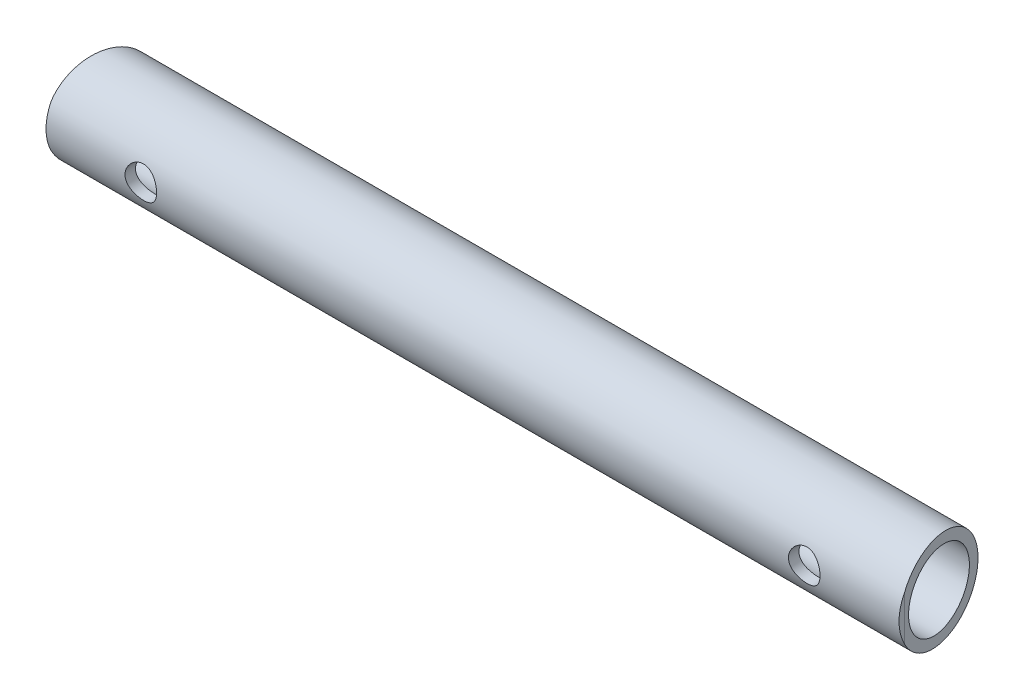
ISO-10303-21;
HEADER;
FILE_DESCRIPTION(('STEP AP214'),'2;1');
FILE_NAME('part.step','',(''),(''),'','','');
FILE_SCHEMA(('AUTOMOTIVE_DESIGN { 1 0 10303 214 1 1 1 1 }'));
ENDSEC;
DATA;
#1=APPLICATION_CONTEXT('core data for automotive mechanical design processes');
#2=APPLICATION_PROTOCOL_DEFINITION('international standard','automotive_design',2000,#1);
#3=PRODUCT_CONTEXT('',#1,'mechanical');
#4=PRODUCT('Part','Part','',(#3));
#5=PRODUCT_RELATED_PRODUCT_CATEGORY('part','',(#4));
#6=PRODUCT_DEFINITION_FORMATION('','',#4);
#7=PRODUCT_DEFINITION_CONTEXT('part definition',#1,'design');
#8=PRODUCT_DEFINITION('design','',#6,#7);
#9=PRODUCT_DEFINITION_SHAPE('','',#8);
#10=(LENGTH_UNIT() NAMED_UNIT(*) SI_UNIT(.MILLI.,.METRE.));
#11=(NAMED_UNIT(*) PLANE_ANGLE_UNIT() SI_UNIT($,.RADIAN.));
#12=(NAMED_UNIT(*) SI_UNIT($,.STERADIAN.) SOLID_ANGLE_UNIT());
#13=UNCERTAINTY_MEASURE_WITH_UNIT(LENGTH_MEASURE(1.E-05),#10,'distance_accuracy_value','');
#14=(GEOMETRIC_REPRESENTATION_CONTEXT(3) GLOBAL_UNCERTAINTY_ASSIGNED_CONTEXT((#13)) GLOBAL_UNIT_ASSIGNED_CONTEXT((#10,
#11,#12)) REPRESENTATION_CONTEXT('',''));
#15=CARTESIAN_POINT('',(0.,0.,0.));
#16=DIRECTION('',(0.,0.,1.));
#17=DIRECTION('',(1.,0.,0.));
#18=AXIS2_PLACEMENT_3D('',#15,#16,#17);
#19=CARTESIAN_POINT('',(-85.725,9.52499999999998,0.));
#20=DIRECTION('',(1.,0.,0.));
#21=DIRECTION('',(0.,0.,-1.));
#22=AXIS2_PLACEMENT_3D('',#19,#20,#21);
#23=PLANE('',#22);
#24=CARTESIAN_POINT('',(-85.725,0.,0.));
#25=DIRECTION('',(-1.,0.,0.));
#26=DIRECTION('',(0.,0.,1.));
#27=AXIS2_PLACEMENT_3D('',#24,#25,#26);
#28=CIRCLE('',#27,9.52499999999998);
#29=CARTESIAN_POINT('',(-85.725,-4.38629045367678,8.45494417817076));
#30=VERTEX_POINT('',#29);
#31=CARTESIAN_POINT('',(-85.725,4.38629045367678,8.45494417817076));
#32=VERTEX_POINT('',#31);
#33=EDGE_CURVE('E75',#30,#32,#28,.T.);
#34=ORIENTED_EDGE('',*,*,#33,.T.);
#35=DIRECTION('',(0.,-1.,0.));
#36=VECTOR('',#35,1.);
#37=CARTESIAN_POINT('',(-85.725,9.52499999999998,8.45494417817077));
#38=LINE('',#37,#36);
#39=EDGE_CURVE('E58',#32,#30,#38,.T.);
#40=ORIENTED_EDGE('',*,*,#39,.T.);
#41=EDGE_LOOP('',(#34,#40));
#42=FACE_BOUND('',#41,.T.);
#43=ADVANCED_FACE('F33',(#42),#23,.F.);
#44=CARTESIAN_POINT('',(0.,0.,0.));
#45=DIRECTION('',(-1.,0.,0.));
#46=DIRECTION('',(0.,0.,1.));
#47=AXIS2_PLACEMENT_3D('',#44,#45,#46);
#48=CYLINDRICAL_SURFACE('',#47,7.41679999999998);
#49=CARTESIAN_POINT('',(69.85,0.,7.41679999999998));
#50=CARTESIAN_POINT('',(69.8499989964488,0.0848685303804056,7.4167992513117));
#51=CARTESIAN_POINT('',(69.8465902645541,0.16976685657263,7.41533786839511));
#52=CARTESIAN_POINT('',(69.8330007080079,0.338935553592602,7.40953686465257));
#53=CARTESIAN_POINT('',(69.8228157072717,0.423205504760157,7.40519546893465));
#54=CARTESIAN_POINT('',(69.7821671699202,0.674445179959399,7.38797152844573));
#55=CARTESIAN_POINT('',(69.7416103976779,0.839625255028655,7.3708896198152));
#56=CARTESIAN_POINT('',(69.6354582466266,1.15961045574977,7.32736691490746));
#57=CARTESIAN_POINT('',(69.5699495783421,1.3144493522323,7.30095855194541));
#58=CARTESIAN_POINT('',(69.4161221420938,1.61081910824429,7.24134158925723));
#59=CARTESIAN_POINT('',(69.3278095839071,1.75235357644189,7.20813484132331));
#60=CARTESIAN_POINT('',(69.1260017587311,2.02569802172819,7.13627384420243));
#61=CARTESIAN_POINT('',(69.0115029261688,2.15671754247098,7.09743485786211));
#62=CARTESIAN_POINT('',(68.7626979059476,2.39838366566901,7.01946076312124));
#63=CARTESIAN_POINT('',(68.6283808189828,2.50901898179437,6.98032550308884));
#64=CARTESIAN_POINT('',(68.335198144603,2.71253529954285,6.90387749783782));
#65=CARTESIAN_POINT('',(68.1754129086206,2.80417626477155,6.86676890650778));
#66=CARTESIAN_POINT('',(67.8408822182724,2.95892796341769,6.80152720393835));
#67=CARTESIAN_POINT('',(67.6661449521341,3.02205419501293,6.77338921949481));
#68=CARTESIAN_POINT('',(67.3157640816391,3.11467625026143,6.73128523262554));
#69=CARTESIAN_POINT('',(67.1406033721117,3.14569687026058,6.71668052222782));
#70=CARTESIAN_POINT('',(66.7870012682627,3.17797871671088,6.70147195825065));
#71=CARTESIAN_POINT('',(66.6085618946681,3.17925769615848,6.70085975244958));
#72=CARTESIAN_POINT('',(66.2690579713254,3.153163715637,6.7131679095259));
#73=CARTESIAN_POINT('',(66.1077658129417,3.12812513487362,6.72498577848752));
#74=CARTESIAN_POINT('',(65.7919416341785,3.05403884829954,6.75895049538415));
#75=CARTESIAN_POINT('',(65.6374110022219,3.00498623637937,6.78109945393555));
#76=CARTESIAN_POINT('',(65.3354856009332,2.88329810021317,6.83373794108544));
#77=CARTESIAN_POINT('',(65.1883199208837,2.81017164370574,6.86439881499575));
#78=CARTESIAN_POINT('',(64.9077552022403,2.64276086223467,6.93057186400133));
#79=CARTESIAN_POINT('',(64.7743617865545,2.54846794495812,6.96608600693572));
#80=CARTESIAN_POINT('',(64.5125366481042,2.33148257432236,7.04183549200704));
#81=CARTESIAN_POINT('',(64.3856226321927,2.20700163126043,7.08220861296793));
#82=CARTESIAN_POINT('',(64.1539460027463,1.93814614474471,7.16045401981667));
#83=CARTESIAN_POINT('',(64.0491891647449,1.79376643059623,7.19832565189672));
#84=CARTESIAN_POINT('',(63.8624039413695,1.48438092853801,7.26851411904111));
#85=CARTESIAN_POINT('',(63.7810258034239,1.31894185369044,7.30066399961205));
#86=CARTESIAN_POINT('',(63.6477949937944,0.974992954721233,7.35449045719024));
#87=CARTESIAN_POINT('',(63.5959250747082,0.796490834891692,7.37617315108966));
#88=CARTESIAN_POINT('',(63.5264357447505,0.444137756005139,7.40545981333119));
#89=CARTESIAN_POINT('',(63.5067815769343,0.270757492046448,7.41389859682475));
#90=CARTESIAN_POINT('',(63.4961746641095,-0.077016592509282,7.41843612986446));
#91=CARTESIAN_POINT('',(63.5052130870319,-0.251410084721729,7.41453867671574));
#92=CARTESIAN_POINT('',(63.5503078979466,-0.586513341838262,7.39537865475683));
#93=CARTESIAN_POINT('',(63.5849066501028,-0.7474584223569,7.38072950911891));
#94=CARTESIAN_POINT('',(63.6780791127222,-1.06106519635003,7.34220943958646));
#95=CARTESIAN_POINT('',(63.736655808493,-1.21372585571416,7.31833736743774));
#96=CARTESIAN_POINT('',(63.8780231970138,-1.51182352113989,7.26271514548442));
#97=CARTESIAN_POINT('',(63.9615128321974,-1.65688614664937,7.23074228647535));
#98=CARTESIAN_POINT('',(64.1495717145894,-1.93146513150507,7.16229158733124));
#99=CARTESIAN_POINT('',(64.2541499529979,-2.06097482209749,7.12581182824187));
#100=CARTESIAN_POINT('',(64.4906048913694,-2.31102378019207,7.0488630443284));
#101=CARTESIAN_POINT('',(64.6239432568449,-2.43015555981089,7.00830034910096));
#102=CARTESIAN_POINT('',(64.9093105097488,-2.64477775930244,6.93016229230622));
#103=CARTESIAN_POINT('',(65.0613445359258,-2.74026165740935,6.89258775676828));
#104=CARTESIAN_POINT('',(65.3835759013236,-2.90624364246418,6.82428763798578));
#105=CARTESIAN_POINT('',(65.5540482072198,-2.97626710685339,6.79369576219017));
#106=CARTESIAN_POINT('',(65.9060935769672,-3.08598792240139,6.74457417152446));
#107=CARTESIAN_POINT('',(66.0876566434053,-3.12571216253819,6.7260337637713));
#108=CARTESIAN_POINT('',(66.4410262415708,-3.17096614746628,6.70480897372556));
#109=CARTESIAN_POINT('',(66.6124458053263,-3.17898510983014,6.70097111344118));
#110=CARTESIAN_POINT('',(66.9541048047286,-3.16732136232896,6.70649259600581));
#111=CARTESIAN_POINT('',(67.1243444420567,-3.14764351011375,6.71584962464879));
#112=CARTESIAN_POINT('',(67.4496852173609,-3.0832734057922,6.74562770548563));
#113=CARTESIAN_POINT('',(67.6051136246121,-3.03993090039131,6.76545000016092));
#114=CARTESIAN_POINT('',(67.9065072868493,-2.93082240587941,6.81342307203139));
#115=CARTESIAN_POINT('',(68.0524698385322,-2.8650500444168,6.84157621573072));
#116=CARTESIAN_POINT('',(68.3406620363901,-2.70827448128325,6.90519670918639));
#117=CARTESIAN_POINT('',(68.4821014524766,-2.61596158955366,6.94100891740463));
#118=CARTESIAN_POINT('',(68.7482613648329,-2.41049684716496,7.01500786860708));
#119=CARTESIAN_POINT('',(68.8729755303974,-2.29733714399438,7.05319550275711));
#120=CARTESIAN_POINT('',(69.1122423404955,-2.04287378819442,7.13124521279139));
#121=CARTESIAN_POINT('',(69.2252242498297,-1.90005657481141,7.17100275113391));
#122=CARTESIAN_POINT('',(69.4257655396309,-1.59594216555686,7.24474147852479));
#123=CARTESIAN_POINT('',(69.5133133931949,-1.43463663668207,7.27872004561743));
#124=CARTESIAN_POINT('',(69.6225808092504,-1.18347380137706,7.32225776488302));
#125=CARTESIAN_POINT('',(69.6551778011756,-1.09882926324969,7.33546627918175));
#126=CARTESIAN_POINT('',(69.7130942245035,-0.926732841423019,7.35918537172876));
#127=CARTESIAN_POINT('',(69.7384171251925,-0.839282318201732,7.36969723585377));
#128=CARTESIAN_POINT('',(69.781450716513,-0.662460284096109,7.38768932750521));
#129=CARTESIAN_POINT('',(69.7991799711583,-0.573094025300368,7.39517694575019));
#130=CARTESIAN_POINT('',(69.8268981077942,-0.393003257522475,7.40692915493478));
#131=CARTESIAN_POINT('',(69.8368925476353,-0.302279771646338,7.41119606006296));
#132=CARTESIAN_POINT('',(69.8453072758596,-0.176125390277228,7.41479215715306));
#133=CARTESIAN_POINT('',(69.8470664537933,-0.140929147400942,7.41554459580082));
#134=CARTESIAN_POINT('',(69.849413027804,-0.0704903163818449,7.41654867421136));
#135=CARTESIAN_POINT('',(69.8500004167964,-0.0352477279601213,7.41680031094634));
#136=CARTESIAN_POINT('',(69.85,0.,7.41679999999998));
#137=B_SPLINE_CURVE_WITH_KNOTS('',3,(#49,#50,#51,#52,#53,#54,#55,#56,#57,#58,#59,#60,#61,#62,
#63,#64,#65,#66,#67,#68,#69,#70,#71,#72,#73,#74,#75,#76,#77,#78,#79,#80,#81,#82,#83,#84,#85,#86,
#87,#88,#89,#90,#91,#92,#93,#94,#95,#96,#97,#98,#99,#100,#101,#102,#103,#104,#105,#106,#107,
#108,#109,#110,#111,#112,#113,#114,#115,#116,#117,#118,#119,#120,#121,#122,#123,#124,#125,#126,
#127,#128,#129,#130,#131,#132,#133,#134,#135,#136),.UNSPECIFIED.,.T.,.F.,(4,2,2,2,2,2,2,2,2,2,2,
2,2,2,2,2,2,2,2,2,2,2,2,2,2,2,2,2,2,2,2,2,2,2,2,2,2,2,2,2,2,2,2,4),(0.,0.254567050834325,
0.509291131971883,1.01938893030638,1.52773002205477,2.0359328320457,2.56847670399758,
3.10131455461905,3.66218072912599,4.22274169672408,4.7552522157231,5.2874448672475,
5.77611896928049,6.26489294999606,6.7643253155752,7.2639607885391,7.80840227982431,
8.35298551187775,8.91150514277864,9.46969798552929,9.99104666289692,10.512234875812,
11.0057946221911,11.4994158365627,12.0084497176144,12.5177010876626,13.0652576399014,
13.6129650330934,14.1704143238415,14.7273683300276,15.2396080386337,15.7517579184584,
16.2373557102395,16.7230915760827,17.2388920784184,17.7548872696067,18.3114667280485,
18.8682980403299,19.1429755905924,19.4175219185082,19.6913931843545,19.9650674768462,
20.0707940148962,20.1765211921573),.UNSPECIFIED.);
#138=CARTESIAN_POINT('',(69.85,0.,7.41679999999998));
#139=VERTEX_POINT('',#138);
#140=EDGE_CURVE('E90',#139,#139,#137,.T.);
#141=ORIENTED_EDGE('',*,*,#140,.T.);
#142=EDGE_LOOP('',(#141));
#143=FACE_BOUND('',#142,.T.);
#144=CARTESIAN_POINT('',(69.85,0.,-7.41679999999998));
#145=CARTESIAN_POINT('',(69.8499989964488,-0.0848685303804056,-7.4167992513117));
#146=CARTESIAN_POINT('',(69.8465902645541,-0.16976685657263,-7.41533786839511));
#147=CARTESIAN_POINT('',(69.8330007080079,-0.338935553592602,-7.40953686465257));
#148=CARTESIAN_POINT('',(69.8228157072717,-0.423205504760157,-7.40519546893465));
#149=CARTESIAN_POINT('',(69.7821671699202,-0.674445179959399,-7.38797152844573));
#150=CARTESIAN_POINT('',(69.7416103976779,-0.839625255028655,-7.3708896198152));
#151=CARTESIAN_POINT('',(69.6354582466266,-1.15961045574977,-7.32736691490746));
#152=CARTESIAN_POINT('',(69.5699495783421,-1.3144493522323,-7.30095855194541));
#153=CARTESIAN_POINT('',(69.4161221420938,-1.61081910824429,-7.24134158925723));
#154=CARTESIAN_POINT('',(69.3278095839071,-1.75235357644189,-7.20813484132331));
#155=CARTESIAN_POINT('',(69.1260017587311,-2.02569802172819,-7.13627384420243));
#156=CARTESIAN_POINT('',(69.0115029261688,-2.15671754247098,-7.09743485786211));
#157=CARTESIAN_POINT('',(68.7626979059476,-2.39838366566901,-7.01946076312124));
#158=CARTESIAN_POINT('',(68.6283808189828,-2.50901898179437,-6.98032550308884));
#159=CARTESIAN_POINT('',(68.335198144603,-2.71253529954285,-6.90387749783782));
#160=CARTESIAN_POINT('',(68.1754129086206,-2.80417626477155,-6.86676890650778));
#161=CARTESIAN_POINT('',(67.8408822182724,-2.95892796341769,-6.80152720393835));
#162=CARTESIAN_POINT('',(67.6661449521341,-3.02205419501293,-6.77338921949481));
#163=CARTESIAN_POINT('',(67.3157640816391,-3.11467625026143,-6.73128523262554));
#164=CARTESIAN_POINT('',(67.1406033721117,-3.14569687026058,-6.71668052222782));
#165=CARTESIAN_POINT('',(66.7870012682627,-3.17797871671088,-6.70147195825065));
#166=CARTESIAN_POINT('',(66.6085618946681,-3.17925769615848,-6.70085975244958));
#167=CARTESIAN_POINT('',(66.2690579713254,-3.153163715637,-6.7131679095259));
#168=CARTESIAN_POINT('',(66.1077658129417,-3.12812513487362,-6.72498577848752));
#169=CARTESIAN_POINT('',(65.7919416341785,-3.05403884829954,-6.75895049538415));
#170=CARTESIAN_POINT('',(65.6374110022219,-3.00498623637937,-6.78109945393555));
#171=CARTESIAN_POINT('',(65.3354856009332,-2.88329810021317,-6.83373794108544));
#172=CARTESIAN_POINT('',(65.1883199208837,-2.81017164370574,-6.86439881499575));
#173=CARTESIAN_POINT('',(64.9077552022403,-2.64276086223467,-6.93057186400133));
#174=CARTESIAN_POINT('',(64.7743617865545,-2.54846794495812,-6.96608600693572));
#175=CARTESIAN_POINT('',(64.5125366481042,-2.33148257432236,-7.04183549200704));
#176=CARTESIAN_POINT('',(64.3856226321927,-2.20700163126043,-7.08220861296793));
#177=CARTESIAN_POINT('',(64.1539460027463,-1.93814614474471,-7.16045401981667));
#178=CARTESIAN_POINT('',(64.0491891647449,-1.79376643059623,-7.19832565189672));
#179=CARTESIAN_POINT('',(63.8624039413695,-1.48438092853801,-7.26851411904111));
#180=CARTESIAN_POINT('',(63.7810258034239,-1.31894185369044,-7.30066399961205));
#181=CARTESIAN_POINT('',(63.6477949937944,-0.974992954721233,-7.35449045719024));
#182=CARTESIAN_POINT('',(63.5959250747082,-0.796490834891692,-7.37617315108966));
#183=CARTESIAN_POINT('',(63.5264357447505,-0.444137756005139,-7.40545981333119));
#184=CARTESIAN_POINT('',(63.5067815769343,-0.270757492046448,-7.41389859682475));
#185=CARTESIAN_POINT('',(63.4961746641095,0.077016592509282,-7.41843612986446));
#186=CARTESIAN_POINT('',(63.5052130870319,0.251410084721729,-7.41453867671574));
#187=CARTESIAN_POINT('',(63.5503078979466,0.586513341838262,-7.39537865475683));
#188=CARTESIAN_POINT('',(63.5849066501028,0.7474584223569,-7.38072950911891));
#189=CARTESIAN_POINT('',(63.6780791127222,1.06106519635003,-7.34220943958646));
#190=CARTESIAN_POINT('',(63.736655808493,1.21372585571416,-7.31833736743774));
#191=CARTESIAN_POINT('',(63.8780231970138,1.51182352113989,-7.26271514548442));
#192=CARTESIAN_POINT('',(63.9615128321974,1.65688614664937,-7.23074228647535));
#193=CARTESIAN_POINT('',(64.1495717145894,1.93146513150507,-7.16229158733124));
#194=CARTESIAN_POINT('',(64.2541499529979,2.06097482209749,-7.12581182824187));
#195=CARTESIAN_POINT('',(64.4906048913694,2.31102378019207,-7.0488630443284));
#196=CARTESIAN_POINT('',(64.6239432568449,2.43015555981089,-7.00830034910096));
#197=CARTESIAN_POINT('',(64.9093105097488,2.64477775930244,-6.93016229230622));
#198=CARTESIAN_POINT('',(65.0613445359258,2.74026165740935,-6.89258775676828));
#199=CARTESIAN_POINT('',(65.3835759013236,2.90624364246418,-6.82428763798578));
#200=CARTESIAN_POINT('',(65.5540482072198,2.97626710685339,-6.79369576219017));
#201=CARTESIAN_POINT('',(65.9060935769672,3.08598792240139,-6.74457417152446));
#202=CARTESIAN_POINT('',(66.0876566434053,3.12571216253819,-6.7260337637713));
#203=CARTESIAN_POINT('',(66.4410262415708,3.17096614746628,-6.70480897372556));
#204=CARTESIAN_POINT('',(66.6124458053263,3.17898510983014,-6.70097111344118));
#205=CARTESIAN_POINT('',(66.9541048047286,3.16732136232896,-6.70649259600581));
#206=CARTESIAN_POINT('',(67.1243444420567,3.14764351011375,-6.71584962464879));
#207=CARTESIAN_POINT('',(67.4496852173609,3.0832734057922,-6.74562770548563));
#208=CARTESIAN_POINT('',(67.6051136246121,3.03993090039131,-6.76545000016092));
#209=CARTESIAN_POINT('',(67.9065072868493,2.93082240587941,-6.81342307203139));
#210=CARTESIAN_POINT('',(68.0524698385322,2.8650500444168,-6.84157621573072));
#211=CARTESIAN_POINT('',(68.3406620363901,2.70827448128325,-6.90519670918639));
#212=CARTESIAN_POINT('',(68.4821014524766,2.61596158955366,-6.94100891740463));
#213=CARTESIAN_POINT('',(68.7482613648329,2.41049684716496,-7.01500786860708));
#214=CARTESIAN_POINT('',(68.8729755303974,2.29733714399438,-7.05319550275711));
#215=CARTESIAN_POINT('',(69.1122423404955,2.04287378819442,-7.13124521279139));
#216=CARTESIAN_POINT('',(69.2252242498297,1.90005657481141,-7.17100275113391));
#217=CARTESIAN_POINT('',(69.4257655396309,1.59594216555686,-7.24474147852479));
#218=CARTESIAN_POINT('',(69.5133133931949,1.43463663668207,-7.27872004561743));
#219=CARTESIAN_POINT('',(69.6225808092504,1.18347380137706,-7.32225776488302));
#220=CARTESIAN_POINT('',(69.6551778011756,1.09882926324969,-7.33546627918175));
#221=CARTESIAN_POINT('',(69.7130942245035,0.926732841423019,-7.35918537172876));
#222=CARTESIAN_POINT('',(69.7384171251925,0.839282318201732,-7.36969723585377));
#223=CARTESIAN_POINT('',(69.781450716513,0.662460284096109,-7.38768932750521));
#224=CARTESIAN_POINT('',(69.7991799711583,0.573094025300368,-7.39517694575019));
#225=CARTESIAN_POINT('',(69.8268981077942,0.393003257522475,-7.40692915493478));
#226=CARTESIAN_POINT('',(69.8368925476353,0.302279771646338,-7.41119606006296));
#227=CARTESIAN_POINT('',(69.8453072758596,0.176125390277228,-7.41479215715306));
#228=CARTESIAN_POINT('',(69.8470664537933,0.140929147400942,-7.41554459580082));
#229=CARTESIAN_POINT('',(69.849413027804,0.0704903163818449,-7.41654867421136));
#230=CARTESIAN_POINT('',(69.8500004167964,0.0352477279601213,-7.41680031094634));
#231=CARTESIAN_POINT('',(69.85,0.,-7.41679999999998));
#232=B_SPLINE_CURVE_WITH_KNOTS('',3,(#144,#145,#146,#147,#148,#149,#150,#151,#152,#153,#154,
#155,#156,#157,#158,#159,#160,#161,#162,#163,#164,#165,#166,#167,#168,#169,#170,#171,#172,#173,
#174,#175,#176,#177,#178,#179,#180,#181,#182,#183,#184,#185,#186,#187,#188,#189,#190,#191,#192,
#193,#194,#195,#196,#197,#198,#199,#200,#201,#202,#203,#204,#205,#206,#207,#208,#209,#210,#211,
#212,#213,#214,#215,#216,#217,#218,#219,#220,#221,#222,#223,#224,#225,#226,#227,#228,#229,#230,
#231),.UNSPECIFIED.,.T.,.F.,(4,2,2,2,2,2,2,2,2,2,2,2,2,2,2,2,2,2,2,2,2,2,2,2,2,2,2,2,2,2,2,2,2,
2,2,2,2,2,2,2,2,2,2,4),(0.,0.254567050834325,0.509291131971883,1.01938893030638,
1.52773002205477,2.0359328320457,2.56847670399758,3.10131455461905,3.66218072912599,
4.22274169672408,4.7552522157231,5.2874448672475,5.77611896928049,6.26489294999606,
6.7643253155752,7.2639607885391,7.80840227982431,8.35298551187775,8.91150514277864,
9.46969798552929,9.99104666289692,10.512234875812,11.0057946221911,11.4994158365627,
12.0084497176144,12.5177010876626,13.0652576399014,13.6129650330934,14.1704143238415,
14.7273683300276,15.2396080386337,15.7517579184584,16.2373557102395,16.7230915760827,
17.2388920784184,17.7548872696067,18.3114667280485,18.8682980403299,19.1429755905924,
19.4175219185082,19.6913931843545,19.9650674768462,20.0707940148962,20.1765211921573),.UNSPECIFIED.);
#233=CARTESIAN_POINT('',(69.85,0.,-7.41679999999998));
#234=VERTEX_POINT('',#233);
#235=EDGE_CURVE('E127',#234,#234,#232,.T.);
#236=ORIENTED_EDGE('',*,*,#235,.T.);
#237=EDGE_LOOP('',(#236));
#238=FACE_BOUND('',#237,.T.);
#239=CARTESIAN_POINT('',(-63.5,0.,7.41679999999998));
#240=CARTESIAN_POINT('',(-63.5000010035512,0.0848685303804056,7.4167992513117));
#241=CARTESIAN_POINT('',(-63.5034097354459,0.16976685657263,7.41533786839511));
#242=CARTESIAN_POINT('',(-63.5169992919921,0.338935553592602,7.40953686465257));
#243=CARTESIAN_POINT('',(-63.5271842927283,0.423205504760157,7.40519546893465));
#244=CARTESIAN_POINT('',(-63.5678328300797,0.674445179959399,7.38797152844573));
#245=CARTESIAN_POINT('',(-63.608389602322,0.839625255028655,7.3708896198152));
#246=CARTESIAN_POINT('',(-63.7145417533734,1.15961045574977,7.32736691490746));
#247=CARTESIAN_POINT('',(-63.7800504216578,1.3144493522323,7.30095855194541));
#248=CARTESIAN_POINT('',(-63.9338778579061,1.61081910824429,7.24134158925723));
#249=CARTESIAN_POINT('',(-64.0221904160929,1.75235357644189,7.20813484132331));
#250=CARTESIAN_POINT('',(-64.2239982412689,2.02569802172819,7.13627384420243));
#251=CARTESIAN_POINT('',(-64.3384970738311,2.15671754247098,7.09743485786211));
#252=CARTESIAN_POINT('',(-64.5873020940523,2.39838366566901,7.01946076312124));
#253=CARTESIAN_POINT('',(-64.7216191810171,2.50901898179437,6.98032550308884));
#254=CARTESIAN_POINT('',(-65.014801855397,2.71253529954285,6.90387749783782));
#255=CARTESIAN_POINT('',(-65.1745870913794,2.80417626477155,6.86676890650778));
#256=CARTESIAN_POINT('',(-65.5091177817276,2.95892796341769,6.80152720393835));
#257=CARTESIAN_POINT('',(-65.6838550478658,3.02205419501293,6.77338921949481));
#258=CARTESIAN_POINT('',(-66.0342359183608,3.11467625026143,6.73128523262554));
#259=CARTESIAN_POINT('',(-66.2093966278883,3.14569687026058,6.71668052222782));
#260=CARTESIAN_POINT('',(-66.5629987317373,3.17797871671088,6.70147195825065));
#261=CARTESIAN_POINT('',(-66.7414381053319,3.17925769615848,6.70085975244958));
#262=CARTESIAN_POINT('',(-67.0809420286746,3.153163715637,6.7131679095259));
#263=CARTESIAN_POINT('',(-67.2422341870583,3.12812513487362,6.72498577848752));
#264=CARTESIAN_POINT('',(-67.5580583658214,3.05403884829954,6.75895049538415));
#265=CARTESIAN_POINT('',(-67.712588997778,3.00498623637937,6.78109945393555));
#266=CARTESIAN_POINT('',(-68.0145143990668,2.88329810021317,6.83373794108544));
#267=CARTESIAN_POINT('',(-68.1616800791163,2.81017164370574,6.86439881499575));
#268=CARTESIAN_POINT('',(-68.4422447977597,2.64276086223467,6.93057186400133));
#269=CARTESIAN_POINT('',(-68.5756382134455,2.54846794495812,6.96608600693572));
#270=CARTESIAN_POINT('',(-68.8374633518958,2.33148257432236,7.04183549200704));
#271=CARTESIAN_POINT('',(-68.9643773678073,2.20700163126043,7.08220861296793));
#272=CARTESIAN_POINT('',(-69.1960539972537,1.93814614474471,7.16045401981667));
#273=CARTESIAN_POINT('',(-69.3008108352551,1.79376643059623,7.19832565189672));
#274=CARTESIAN_POINT('',(-69.4875960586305,1.48438092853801,7.26851411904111));
#275=CARTESIAN_POINT('',(-69.5689741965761,1.31894185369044,7.30066399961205));
#276=CARTESIAN_POINT('',(-69.7022050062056,0.974992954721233,7.35449045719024));
#277=CARTESIAN_POINT('',(-69.7540749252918,0.796490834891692,7.37617315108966));
#278=CARTESIAN_POINT('',(-69.8235642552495,0.444137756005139,7.40545981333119));
#279=CARTESIAN_POINT('',(-69.8432184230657,0.270757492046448,7.41389859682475));
#280=CARTESIAN_POINT('',(-69.8538253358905,-0.077016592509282,7.41843612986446));
#281=CARTESIAN_POINT('',(-69.844786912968,-0.251410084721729,7.41453867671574));
#282=CARTESIAN_POINT('',(-69.7996921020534,-0.586513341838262,7.39537865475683));
#283=CARTESIAN_POINT('',(-69.7650933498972,-0.7474584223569,7.38072950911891));
#284=CARTESIAN_POINT('',(-69.6719208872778,-1.06106519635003,7.34220943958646));
#285=CARTESIAN_POINT('',(-69.6133441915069,-1.21372585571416,7.31833736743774));
#286=CARTESIAN_POINT('',(-69.4719768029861,-1.51182352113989,7.26271514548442));
#287=CARTESIAN_POINT('',(-69.3884871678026,-1.65688614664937,7.23074228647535));
#288=CARTESIAN_POINT('',(-69.2004282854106,-1.93146513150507,7.16229158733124));
#289=CARTESIAN_POINT('',(-69.0958500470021,-2.06097482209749,7.12581182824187));
#290=CARTESIAN_POINT('',(-68.8593951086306,-2.31102378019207,7.0488630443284));
#291=CARTESIAN_POINT('',(-68.7260567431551,-2.43015555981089,7.00830034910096));
#292=CARTESIAN_POINT('',(-68.4406894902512,-2.64477775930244,6.93016229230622));
#293=CARTESIAN_POINT('',(-68.2886554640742,-2.74026165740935,6.89258775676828));
#294=CARTESIAN_POINT('',(-67.9664240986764,-2.90624364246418,6.82428763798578));
#295=CARTESIAN_POINT('',(-67.7959517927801,-2.97626710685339,6.79369576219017));
#296=CARTESIAN_POINT('',(-67.4439064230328,-3.08598792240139,6.74457417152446));
#297=CARTESIAN_POINT('',(-67.2623433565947,-3.12571216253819,6.7260337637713));
#298=CARTESIAN_POINT('',(-66.9089737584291,-3.17096614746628,6.70480897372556));
#299=CARTESIAN_POINT('',(-66.7375541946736,-3.17898510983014,6.70097111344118));
#300=CARTESIAN_POINT('',(-66.3958951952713,-3.16732136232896,6.70649259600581));
#301=CARTESIAN_POINT('',(-66.2256555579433,-3.14764351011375,6.71584962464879));
#302=CARTESIAN_POINT('',(-65.9003147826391,-3.0832734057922,6.74562770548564));
#303=CARTESIAN_POINT('',(-65.7448863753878,-3.03993090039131,6.76545000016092));
#304=CARTESIAN_POINT('',(-65.4434927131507,-2.93082240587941,6.81342307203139));
#305=CARTESIAN_POINT('',(-65.2975301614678,-2.8650500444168,6.84157621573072));
#306=CARTESIAN_POINT('',(-65.0093379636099,-2.70827448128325,6.90519670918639));
#307=CARTESIAN_POINT('',(-64.8678985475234,-2.61596158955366,6.94100891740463));
#308=CARTESIAN_POINT('',(-64.6017386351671,-2.41049684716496,7.01500786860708));
#309=CARTESIAN_POINT('',(-64.4770244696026,-2.29733714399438,7.05319550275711));
#310=CARTESIAN_POINT('',(-64.2377576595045,-2.04287378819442,7.13124521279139));
#311=CARTESIAN_POINT('',(-64.1247757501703,-1.90005657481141,7.17100275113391));
#312=CARTESIAN_POINT('',(-63.924234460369,-1.59594216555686,7.24474147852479));
#313=CARTESIAN_POINT('',(-63.8366866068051,-1.43463663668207,7.27872004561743));
#314=CARTESIAN_POINT('',(-63.7274191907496,-1.18347380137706,7.32225776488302));
#315=CARTESIAN_POINT('',(-63.6948221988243,-1.09882926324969,7.33546627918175));
#316=CARTESIAN_POINT('',(-63.6369057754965,-0.926732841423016,7.35918537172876));
#317=CARTESIAN_POINT('',(-63.6115828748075,-0.839282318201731,7.36969723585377));
#318=CARTESIAN_POINT('',(-63.5685492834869,-0.662460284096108,7.38768932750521));
#319=CARTESIAN_POINT('',(-63.5508200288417,-0.573094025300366,7.39517694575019));
#320=CARTESIAN_POINT('',(-63.5231018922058,-0.393003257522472,7.40692915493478));
#321=CARTESIAN_POINT('',(-63.5131074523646,-0.302279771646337,7.41119606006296));
#322=CARTESIAN_POINT('',(-63.5046927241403,-0.176125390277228,7.41479215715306));
#323=CARTESIAN_POINT('',(-63.5029335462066,-0.140929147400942,7.41554459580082));
#324=CARTESIAN_POINT('',(-63.500586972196,-0.0704903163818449,7.41654867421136));
#325=CARTESIAN_POINT('',(-63.4999995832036,-0.0352477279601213,7.41680031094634));
#326=CARTESIAN_POINT('',(-63.5,0.,7.41679999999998));
#327=B_SPLINE_CURVE_WITH_KNOTS('',3,(#239,#240,#241,#242,#243,#244,#245,#246,#247,#248,#249,
#250,#251,#252,#253,#254,#255,#256,#257,#258,#259,#260,#261,#262,#263,#264,#265,#266,#267,#268,
#269,#270,#271,#272,#273,#274,#275,#276,#277,#278,#279,#280,#281,#282,#283,#284,#285,#286,#287,
#288,#289,#290,#291,#292,#293,#294,#295,#296,#297,#298,#299,#300,#301,#302,#303,#304,#305,#306,
#307,#308,#309,#310,#311,#312,#313,#314,#315,#316,#317,#318,#319,#320,#321,#322,#323,#324,#325,
#326),.UNSPECIFIED.,.T.,.F.,(4,2,2,2,2,2,2,2,2,2,2,2,2,2,2,2,2,2,2,2,2,2,2,2,2,2,2,2,2,2,2,2,2,
2,2,2,2,2,2,2,2,2,2,4),(0.,0.254567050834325,0.509291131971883,1.01938893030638,
1.52773002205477,2.0359328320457,2.56847670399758,3.10131455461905,3.66218072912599,
4.22274169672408,4.7552522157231,5.2874448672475,5.77611896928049,6.26489294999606,
6.76432531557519,7.2639607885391,7.80840227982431,8.35298551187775,8.91150514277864,
9.46969798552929,9.99104666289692,10.512234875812,11.0057946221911,11.4994158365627,
12.0084497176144,12.5177010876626,13.0652576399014,13.6129650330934,14.1704143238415,
14.7273683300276,15.2396080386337,15.7517579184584,16.2373557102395,16.7230915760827,
17.2388920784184,17.7548872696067,18.3114667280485,18.8682980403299,19.1429755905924,
19.4175219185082,19.6913931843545,19.9650674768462,20.0707940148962,20.1765211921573),.UNSPECIFIED.);
#328=CARTESIAN_POINT('',(-63.5,0.,7.41679999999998));
#329=VERTEX_POINT('',#328);
#330=EDGE_CURVE('E72',#329,#329,#327,.T.);
#331=ORIENTED_EDGE('',*,*,#330,.T.);
#332=EDGE_LOOP('',(#331));
#333=FACE_BOUND('',#332,.T.);
#334=CARTESIAN_POINT('',(-63.5,0.,-7.41679999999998));
#335=CARTESIAN_POINT('',(-63.5000010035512,-0.0848685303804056,-7.4167992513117));
#336=CARTESIAN_POINT('',(-63.5034097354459,-0.16976685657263,-7.41533786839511));
#337=CARTESIAN_POINT('',(-63.5169992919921,-0.338935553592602,-7.40953686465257));
#338=CARTESIAN_POINT('',(-63.5271842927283,-0.423205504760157,-7.40519546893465));
#339=CARTESIAN_POINT('',(-63.5678328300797,-0.674445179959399,-7.38797152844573));
#340=CARTESIAN_POINT('',(-63.608389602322,-0.839625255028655,-7.3708896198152));
#341=CARTESIAN_POINT('',(-63.7145417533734,-1.15961045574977,-7.32736691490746));
#342=CARTESIAN_POINT('',(-63.7800504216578,-1.3144493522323,-7.30095855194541));
#343=CARTESIAN_POINT('',(-63.9338778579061,-1.61081910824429,-7.24134158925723));
#344=CARTESIAN_POINT('',(-64.0221904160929,-1.75235357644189,-7.20813484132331));
#345=CARTESIAN_POINT('',(-64.2239982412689,-2.02569802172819,-7.13627384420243));
#346=CARTESIAN_POINT('',(-64.3384970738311,-2.15671754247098,-7.09743485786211));
#347=CARTESIAN_POINT('',(-64.5873020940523,-2.39838366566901,-7.01946076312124));
#348=CARTESIAN_POINT('',(-64.7216191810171,-2.50901898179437,-6.98032550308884));
#349=CARTESIAN_POINT('',(-65.014801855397,-2.71253529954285,-6.90387749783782));
#350=CARTESIAN_POINT('',(-65.1745870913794,-2.80417626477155,-6.86676890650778));
#351=CARTESIAN_POINT('',(-65.5091177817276,-2.95892796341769,-6.80152720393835));
#352=CARTESIAN_POINT('',(-65.6838550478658,-3.02205419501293,-6.77338921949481));
#353=CARTESIAN_POINT('',(-66.0342359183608,-3.11467625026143,-6.73128523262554));
#354=CARTESIAN_POINT('',(-66.2093966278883,-3.14569687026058,-6.71668052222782));
#355=CARTESIAN_POINT('',(-66.5629987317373,-3.17797871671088,-6.70147195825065));
#356=CARTESIAN_POINT('',(-66.7414381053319,-3.17925769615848,-6.70085975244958));
#357=CARTESIAN_POINT('',(-67.0809420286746,-3.153163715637,-6.7131679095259));
#358=CARTESIAN_POINT('',(-67.2422341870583,-3.12812513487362,-6.72498577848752));
#359=CARTESIAN_POINT('',(-67.5580583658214,-3.05403884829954,-6.75895049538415));
#360=CARTESIAN_POINT('',(-67.712588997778,-3.00498623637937,-6.78109945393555));
#361=CARTESIAN_POINT('',(-68.0145143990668,-2.88329810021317,-6.83373794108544));
#362=CARTESIAN_POINT('',(-68.1616800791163,-2.81017164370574,-6.86439881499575));
#363=CARTESIAN_POINT('',(-68.4422447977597,-2.64276086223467,-6.93057186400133));
#364=CARTESIAN_POINT('',(-68.5756382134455,-2.54846794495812,-6.96608600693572));
#365=CARTESIAN_POINT('',(-68.8374633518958,-2.33148257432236,-7.04183549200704));
#366=CARTESIAN_POINT('',(-68.9643773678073,-2.20700163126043,-7.08220861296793));
#367=CARTESIAN_POINT('',(-69.1960539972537,-1.93814614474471,-7.16045401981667));
#368=CARTESIAN_POINT('',(-69.3008108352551,-1.79376643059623,-7.19832565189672));
#369=CARTESIAN_POINT('',(-69.4875960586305,-1.48438092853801,-7.26851411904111));
#370=CARTESIAN_POINT('',(-69.5689741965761,-1.31894185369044,-7.30066399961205));
#371=CARTESIAN_POINT('',(-69.7022050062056,-0.974992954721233,-7.35449045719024));
#372=CARTESIAN_POINT('',(-69.7540749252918,-0.796490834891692,-7.37617315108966));
#373=CARTESIAN_POINT('',(-69.8235642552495,-0.444137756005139,-7.40545981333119));
#374=CARTESIAN_POINT('',(-69.8432184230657,-0.270757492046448,-7.41389859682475));
#375=CARTESIAN_POINT('',(-69.8538253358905,0.077016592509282,-7.41843612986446));
#376=CARTESIAN_POINT('',(-69.844786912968,0.251410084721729,-7.41453867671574));
#377=CARTESIAN_POINT('',(-69.7996921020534,0.586513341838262,-7.39537865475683));
#378=CARTESIAN_POINT('',(-69.7650933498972,0.7474584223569,-7.38072950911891));
#379=CARTESIAN_POINT('',(-69.6719208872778,1.06106519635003,-7.34220943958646));
#380=CARTESIAN_POINT('',(-69.6133441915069,1.21372585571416,-7.31833736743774));
#381=CARTESIAN_POINT('',(-69.4719768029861,1.51182352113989,-7.26271514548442));
#382=CARTESIAN_POINT('',(-69.3884871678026,1.65688614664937,-7.23074228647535));
#383=CARTESIAN_POINT('',(-69.2004282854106,1.93146513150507,-7.16229158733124));
#384=CARTESIAN_POINT('',(-69.0958500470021,2.06097482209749,-7.12581182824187));
#385=CARTESIAN_POINT('',(-68.8593951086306,2.31102378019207,-7.0488630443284));
#386=CARTESIAN_POINT('',(-68.7260567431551,2.43015555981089,-7.00830034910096));
#387=CARTESIAN_POINT('',(-68.4406894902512,2.64477775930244,-6.93016229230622));
#388=CARTESIAN_POINT('',(-68.2886554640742,2.74026165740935,-6.89258775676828));
#389=CARTESIAN_POINT('',(-67.9664240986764,2.90624364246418,-6.82428763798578));
#390=CARTESIAN_POINT('',(-67.7959517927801,2.97626710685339,-6.79369576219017));
#391=CARTESIAN_POINT('',(-67.4439064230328,3.08598792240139,-6.74457417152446));
#392=CARTESIAN_POINT('',(-67.2623433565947,3.12571216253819,-6.7260337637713));
#393=CARTESIAN_POINT('',(-66.9089737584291,3.17096614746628,-6.70480897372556));
#394=CARTESIAN_POINT('',(-66.7375541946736,3.17898510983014,-6.70097111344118));
#395=CARTESIAN_POINT('',(-66.3958951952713,3.16732136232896,-6.70649259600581));
#396=CARTESIAN_POINT('',(-66.2256555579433,3.14764351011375,-6.71584962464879));
#397=CARTESIAN_POINT('',(-65.9003147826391,3.0832734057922,-6.74562770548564));
#398=CARTESIAN_POINT('',(-65.7448863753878,3.03993090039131,-6.76545000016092));
#399=CARTESIAN_POINT('',(-65.4434927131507,2.93082240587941,-6.81342307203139));
#400=CARTESIAN_POINT('',(-65.2975301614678,2.8650500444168,-6.84157621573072));
#401=CARTESIAN_POINT('',(-65.0093379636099,2.70827448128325,-6.90519670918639));
#402=CARTESIAN_POINT('',(-64.8678985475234,2.61596158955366,-6.94100891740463));
#403=CARTESIAN_POINT('',(-64.6017386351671,2.41049684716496,-7.01500786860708));
#404=CARTESIAN_POINT('',(-64.4770244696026,2.29733714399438,-7.05319550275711));
#405=CARTESIAN_POINT('',(-64.2377576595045,2.04287378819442,-7.13124521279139));
#406=CARTESIAN_POINT('',(-64.1247757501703,1.90005657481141,-7.17100275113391));
#407=CARTESIAN_POINT('',(-63.924234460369,1.59594216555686,-7.24474147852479));
#408=CARTESIAN_POINT('',(-63.8366866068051,1.43463663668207,-7.27872004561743));
#409=CARTESIAN_POINT('',(-63.7274191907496,1.18347380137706,-7.32225776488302));
#410=CARTESIAN_POINT('',(-63.6948221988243,1.09882926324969,-7.33546627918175));
#411=CARTESIAN_POINT('',(-63.6369057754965,0.926732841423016,-7.35918537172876));
#412=CARTESIAN_POINT('',(-63.6115828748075,0.839282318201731,-7.36969723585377));
#413=CARTESIAN_POINT('',(-63.5685492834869,0.662460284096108,-7.38768932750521));
#414=CARTESIAN_POINT('',(-63.5508200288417,0.573094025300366,-7.39517694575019));
#415=CARTESIAN_POINT('',(-63.5231018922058,0.393003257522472,-7.40692915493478));
#416=CARTESIAN_POINT('',(-63.5131074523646,0.302279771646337,-7.41119606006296));
#417=CARTESIAN_POINT('',(-63.5046927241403,0.176125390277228,-7.41479215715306));
#418=CARTESIAN_POINT('',(-63.5029335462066,0.140929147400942,-7.41554459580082));
#419=CARTESIAN_POINT('',(-63.500586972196,0.0704903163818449,-7.41654867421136));
#420=CARTESIAN_POINT('',(-63.4999995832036,0.0352477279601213,-7.41680031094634));
#421=CARTESIAN_POINT('',(-63.5,0.,-7.41679999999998));
#422=B_SPLINE_CURVE_WITH_KNOTS('',3,(#334,#335,#336,#337,#338,#339,#340,#341,#342,#343,#344,
#345,#346,#347,#348,#349,#350,#351,#352,#353,#354,#355,#356,#357,#358,#359,#360,#361,#362,#363,
#364,#365,#366,#367,#368,#369,#370,#371,#372,#373,#374,#375,#376,#377,#378,#379,#380,#381,#382,
#383,#384,#385,#386,#387,#388,#389,#390,#391,#392,#393,#394,#395,#396,#397,#398,#399,#400,#401,
#402,#403,#404,#405,#406,#407,#408,#409,#410,#411,#412,#413,#414,#415,#416,#417,#418,#419,#420,
#421),.UNSPECIFIED.,.T.,.F.,(4,2,2,2,2,2,2,2,2,2,2,2,2,2,2,2,2,2,2,2,2,2,2,2,2,2,2,2,2,2,2,2,2,
2,2,2,2,2,2,2,2,2,2,4),(0.,0.254567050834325,0.509291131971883,1.01938893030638,
1.52773002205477,2.0359328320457,2.56847670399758,3.10131455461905,3.66218072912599,
4.22274169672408,4.7552522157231,5.2874448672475,5.77611896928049,6.26489294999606,
6.76432531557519,7.2639607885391,7.80840227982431,8.35298551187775,8.91150514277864,
9.46969798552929,9.99104666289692,10.512234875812,11.0057946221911,11.4994158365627,
12.0084497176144,12.5177010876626,13.0652576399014,13.6129650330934,14.1704143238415,
14.7273683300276,15.2396080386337,15.7517579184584,16.2373557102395,16.7230915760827,
17.2388920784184,17.7548872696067,18.3114667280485,18.8682980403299,19.1429755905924,
19.4175219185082,19.6913931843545,19.9650674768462,20.0707940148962,20.1765211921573),.UNSPECIFIED.);
#423=CARTESIAN_POINT('',(-63.5,0.,-7.41679999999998));
#424=VERTEX_POINT('',#423);
#425=EDGE_CURVE('E110',#424,#424,#422,.T.);
#426=ORIENTED_EDGE('',*,*,#425,.T.);
#427=EDGE_LOOP('',(#426));
#428=FACE_BOUND('',#427,.T.);
#429=CARTESIAN_POINT('',(84.2341652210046,0.,0.));
#430=DIRECTION('',(-0.984807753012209,0.,0.173648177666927));
#431=DIRECTION('',(-0.173648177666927,0.,-0.984807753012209));
#432=AXIS2_PLACEMENT_3D('',#429,#430,#431);
#433=ELLIPSE('',#432,7.53121609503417,7.41679999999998);
#434=CARTESIAN_POINT('',(82.926383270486,0.,-7.41679999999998));
#435=VERTEX_POINT('',#434);
#436=EDGE_CURVE('E71',#435,#435,#433,.F.);
#437=ORIENTED_EDGE('',*,*,#436,.T.);
#438=EDGE_LOOP('',(#437));
#439=FACE_BOUND('',#438,.T.);
#440=CARTESIAN_POINT('',(-84.2341652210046,0.,0.));
#441=DIRECTION('',(0.984807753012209,0.,0.173648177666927));
#442=DIRECTION('',(-0.173648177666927,0.,0.984807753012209));
#443=AXIS2_PLACEMENT_3D('',#440,#441,#442);
#444=ELLIPSE('',#443,7.53121609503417,7.41679999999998);
#445=CARTESIAN_POINT('',(-85.5419471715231,0.,7.41679999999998));
#446=VERTEX_POINT('',#445);
#447=EDGE_CURVE('E79',#446,#446,#444,.F.);
#448=ORIENTED_EDGE('',*,*,#447,.T.);
#449=EDGE_LOOP('',(#448));
#450=FACE_BOUND('',#449,.T.);
#451=ADVANCED_FACE('F120',(#143,#238,#333,#428,#439,#450),#48,.F.);
#452=CARTESIAN_POINT('',(85.725,7.41679999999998,0.));
#453=DIRECTION('',(-1.,0.,0.));
#454=DIRECTION('',(0.,0.,1.));
#455=AXIS2_PLACEMENT_3D('',#452,#453,#454);
#456=PLANE('',#455);
#457=CARTESIAN_POINT('',(85.725,0.,0.));
#458=DIRECTION('',(-1.,0.,0.));
#459=DIRECTION('',(0.,0.,1.));
#460=AXIS2_PLACEMENT_3D('',#457,#458,#459);
#461=CIRCLE('',#460,9.52499999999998);
#462=CARTESIAN_POINT('',(85.725,-4.38629045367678,8.45494417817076));
#463=VERTEX_POINT('',#462);
#464=CARTESIAN_POINT('',(85.725,4.38629045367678,8.45494417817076));
#465=VERTEX_POINT('',#464);
#466=EDGE_CURVE('E70',#463,#465,#461,.T.);
#467=ORIENTED_EDGE('',*,*,#466,.F.);
#468=DIRECTION('',(0.,1.,0.));
#469=VECTOR('',#468,1.);
#470=CARTESIAN_POINT('',(85.725,7.41679999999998,8.45494417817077));
#471=LINE('',#470,#469);
#472=EDGE_CURVE('E52',#463,#465,#471,.T.);
#473=ORIENTED_EDGE('',*,*,#472,.T.);
#474=EDGE_LOOP('',(#467,#473));
#475=FACE_BOUND('',#474,.T.);
#476=ADVANCED_FACE('F69',(#475),#456,.F.);
#477=CARTESIAN_POINT('',(0.,0.,0.));
#478=DIRECTION('',(-1.,0.,0.));
#479=DIRECTION('',(0.,0.,1.));
#480=AXIS2_PLACEMENT_3D('',#477,#478,#479);
#481=CYLINDRICAL_SURFACE('',#480,9.52499999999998);
#482=CARTESIAN_POINT('',(69.85,0.,9.52499999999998));
#483=CARTESIAN_POINT('',(69.8500008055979,-0.173238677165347,9.52500048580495));
#484=CARTESIAN_POINT('',(69.8357751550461,-0.346472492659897,9.52023018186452));
#485=CARTESIAN_POINT('',(69.7794225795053,-0.687837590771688,9.50167042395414));
#486=CARTESIAN_POINT('',(69.7372927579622,-0.855968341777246,9.48788003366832));
#487=CARTESIAN_POINT('',(69.6267364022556,-1.18215660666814,9.45277852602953));
#488=CARTESIAN_POINT('',(69.5583538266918,-1.34023044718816,9.43147998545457));
#489=CARTESIAN_POINT('',(69.3974317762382,-1.6426654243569,9.38353615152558));
#490=CARTESIAN_POINT('',(69.3048875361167,-1.78702384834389,9.35688980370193));
#491=CARTESIAN_POINT('',(69.0949030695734,-2.0629298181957,9.30002249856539));
#492=CARTESIAN_POINT('',(68.9767758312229,-2.19393674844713,9.26971591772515));
#493=CARTESIAN_POINT('',(68.7204392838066,-2.43469379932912,9.20941499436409));
#494=CARTESIAN_POINT('',(68.582225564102,-2.54443923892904,9.17942072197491));
#495=CARTESIAN_POINT('',(68.2847722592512,-2.74264419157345,9.12219830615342));
#496=CARTESIAN_POINT('',(68.1250423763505,-2.83040092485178,9.09507449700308));
#497=CARTESIAN_POINT('',(67.7920409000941,-2.97757492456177,9.04796594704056));
#498=CARTESIAN_POINT('',(67.6187734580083,-3.03700083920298,9.02797902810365));
#499=CARTESIAN_POINT('',(67.2697625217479,-3.12379824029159,8.99830887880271));
#500=CARTESIAN_POINT('',(67.0942993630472,-3.15218269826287,8.98830104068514));
#501=CARTESIAN_POINT('',(66.7408375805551,-3.17925806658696,8.97876209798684));
#502=CARTESIAN_POINT('',(66.5628397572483,-3.17795815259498,8.97922775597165));
#503=CARTESIAN_POINT('',(66.2180011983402,-3.14648819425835,8.9902987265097));
#504=CARTESIAN_POINT('',(66.0510223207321,-3.11764017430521,9.00043970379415));
#505=CARTESIAN_POINT('',(65.7244258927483,-3.0340495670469,9.02895888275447));
#506=CARTESIAN_POINT('',(65.5648092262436,-2.97930387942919,9.0473380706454));
#507=CARTESIAN_POINT('',(65.2544645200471,-2.84460650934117,9.09059367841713));
#508=CARTESIAN_POINT('',(65.1039210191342,-2.76426310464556,9.11556996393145));
#509=CARTESIAN_POINT('',(64.8180348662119,-2.58092291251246,9.16916373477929));
#510=CARTESIAN_POINT('',(64.6826966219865,-2.47791958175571,9.1977822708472));
#511=CARTESIAN_POINT('',(64.4236341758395,-2.2458341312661,9.25726270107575));
#512=CARTESIAN_POINT('',(64.3008851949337,-2.11567125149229,9.28816371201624));
#513=CARTESIAN_POINT('',(64.0787032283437,-1.83622813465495,9.3474202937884));
#514=CARTESIAN_POINT('',(63.9792724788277,-1.68694606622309,9.37577562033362));
#515=CARTESIAN_POINT('',(63.8057642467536,-1.3714336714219,9.42711817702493));
#516=CARTESIAN_POINT('',(63.7319480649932,-1.20504990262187,9.45004936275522));
#517=CARTESIAN_POINT('',(63.6136549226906,-0.861279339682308,9.48755300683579));
#518=CARTESIAN_POINT('',(63.5691677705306,-0.683896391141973,9.5021283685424));
#519=CARTESIAN_POINT('',(63.512523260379,-0.331418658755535,9.52079715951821));
#520=CARTESIAN_POINT('',(63.4990481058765,-0.156557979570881,9.52531755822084));
#521=CARTESIAN_POINT('',(63.5010562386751,0.192960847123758,9.52464766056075));
#522=CARTESIAN_POINT('',(63.5165346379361,0.367619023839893,9.51945900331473));
#523=CARTESIAN_POINT('',(63.5749678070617,0.706500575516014,9.50023578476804));
#524=CARTESIAN_POINT('',(63.6171137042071,0.870879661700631,9.48646180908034));
#525=CARTESIAN_POINT('',(63.7266741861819,1.19016766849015,9.4517161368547));
#526=CARTESIAN_POINT('',(63.7940919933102,1.34507537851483,9.43074352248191));
#527=CARTESIAN_POINT('',(63.9542486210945,1.64556534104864,9.38304356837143));
#528=CARTESIAN_POINT('',(64.0476068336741,1.79079512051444,9.35617936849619));
#529=CARTESIAN_POINT('',(64.2562664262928,2.06395583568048,9.29974181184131));
#530=CARTESIAN_POINT('',(64.3715745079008,2.19188146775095,9.27016762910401));
#531=CARTESIAN_POINT('',(64.6270575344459,2.432851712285,9.2099399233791));
#532=CARTESIAN_POINT('',(64.7681242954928,2.54495607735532,9.17929841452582));
#533=CARTESIAN_POINT('',(65.0677247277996,2.74401763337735,9.12177415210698));
#534=CARTESIAN_POINT('',(65.2262585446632,2.83097461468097,9.09489142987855));
#535=CARTESIAN_POINT('',(65.5563618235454,2.97687025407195,9.0481909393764));
#536=CARTESIAN_POINT('',(65.7279041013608,3.03586556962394,9.02835890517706));
#537=CARTESIAN_POINT('',(66.0793022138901,3.12386556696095,8.99829392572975));
#538=CARTESIAN_POINT('',(66.2591542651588,3.15288375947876,8.98805665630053));
#539=CARTESIAN_POINT('',(66.6121257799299,3.17905219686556,8.9788320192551));
#540=CARTESIAN_POINT('',(66.7851164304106,3.17776306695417,8.97929370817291));
#541=CARTESIAN_POINT('',(67.1282791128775,3.1471942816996,8.99005281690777));
#542=CARTESIAN_POINT('',(67.2984513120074,3.11791629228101,9.00034965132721));
#543=CARTESIAN_POINT('',(67.6279307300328,3.03330550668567,9.02920864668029));
#544=CARTESIAN_POINT('',(67.7873829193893,2.97847812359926,9.04761011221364));
#545=CARTESIAN_POINT('',(68.094947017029,2.84473448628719,9.09054566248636));
#546=CARTESIAN_POINT('',(68.2430563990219,2.76581288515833,9.11508110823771));
#547=CARTESIAN_POINT('',(68.5307356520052,2.58210269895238,9.16885482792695));
#548=CARTESIAN_POINT('',(68.6696508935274,2.47633567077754,9.19825159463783));
#549=CARTESIAN_POINT('',(68.9282651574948,2.24359115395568,9.25777156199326));
#550=CARTESIAN_POINT('',(69.0479587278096,2.11660766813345,9.2878949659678));
#551=CARTESIAN_POINT('',(69.2694335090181,1.83909194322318,9.346883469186));
#552=CARTESIAN_POINT('',(69.3703348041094,1.68783480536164,9.37565377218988));
#553=CARTESIAN_POINT('',(69.5451696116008,1.36955960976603,9.42740021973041));
#554=CARTESIAN_POINT('',(69.6191100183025,1.20254559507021,9.45037784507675));
#555=CARTESIAN_POINT('',(69.7348161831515,0.865167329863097,9.48707510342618));
#556=CARTESIAN_POINT('',(69.7778718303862,0.695286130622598,9.50116249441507));
#557=CARTESIAN_POINT('',(69.8354593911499,0.350267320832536,9.52012342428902));
#558=CARTESIAN_POINT('',(69.8499991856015,0.175131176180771,9.52499950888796));
#559=CARTESIAN_POINT('',(69.85,0.,9.52499999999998));
#560=B_SPLINE_CURVE_WITH_KNOTS('',3,(#482,#483,#484,#485,#486,#487,#488,#489,#490,#491,#492,
#493,#494,#495,#496,#497,#498,#499,#500,#501,#502,#503,#504,#505,#506,#507,#508,#509,#510,#511,
#512,#513,#514,#515,#516,#517,#518,#519,#520,#521,#522,#523,#524,#525,#526,#527,#528,#529,#530,
#531,#532,#533,#534,#535,#536,#537,#538,#539,#540,#541,#542,#543,#544,#545,#546,#547,#548,#549,
#550,#551,#552,#553,#554,#555,#556,#557,#558,#559),.UNSPECIFIED.,.T.,.F.,(4,2,2,2,2,2,2,2,2,2,2,
2,2,2,2,2,2,2,2,2,2,2,2,2,2,2,2,2,2,2,2,2,2,2,2,2,2,2,4),(0.,0.519071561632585,1.03819701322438,
1.55645698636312,2.07481924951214,2.60936372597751,3.14402575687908,3.69406121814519,
4.24392866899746,4.77526114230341,5.30642937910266,5.81332424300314,6.32027980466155,
6.83539943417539,7.35066800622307,7.89283745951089,8.43505888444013,8.98265937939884,
9.53006948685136,10.0537512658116,10.5773446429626,11.0857715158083,11.5942632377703,
12.1161301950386,12.638156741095,13.1839024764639,13.7296527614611,14.274292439,
14.8186865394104,15.3351123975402,15.8515075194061,16.3580948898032,16.8647947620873,
17.3936046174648,17.92256420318,18.4721392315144,19.0215736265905,19.5464607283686,
20.0712027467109),.UNSPECIFIED.);
#561=CARTESIAN_POINT('',(69.85,0.,9.52499999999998));
#562=VERTEX_POINT('',#561);
#563=EDGE_CURVE('E36',#562,#562,#560,.T.);
#564=ORIENTED_EDGE('',*,*,#563,.T.);
#565=EDGE_LOOP('',(#564));
#566=FACE_BOUND('',#565,.T.);
#567=CARTESIAN_POINT('',(69.85,0.,-9.52499999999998));
#568=CARTESIAN_POINT('',(69.8500008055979,0.173238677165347,-9.52500048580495));
#569=CARTESIAN_POINT('',(69.8357751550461,0.346472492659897,-9.52023018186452));
#570=CARTESIAN_POINT('',(69.7794225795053,0.687837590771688,-9.50167042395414));
#571=CARTESIAN_POINT('',(69.7372927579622,0.855968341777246,-9.48788003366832));
#572=CARTESIAN_POINT('',(69.6267364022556,1.18215660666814,-9.45277852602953));
#573=CARTESIAN_POINT('',(69.5583538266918,1.34023044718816,-9.43147998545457));
#574=CARTESIAN_POINT('',(69.3974317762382,1.6426654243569,-9.38353615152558));
#575=CARTESIAN_POINT('',(69.3048875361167,1.78702384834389,-9.35688980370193));
#576=CARTESIAN_POINT('',(69.0949030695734,2.0629298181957,-9.30002249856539));
#577=CARTESIAN_POINT('',(68.9767758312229,2.19393674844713,-9.26971591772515));
#578=CARTESIAN_POINT('',(68.7204392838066,2.43469379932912,-9.20941499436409));
#579=CARTESIAN_POINT('',(68.582225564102,2.54443923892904,-9.17942072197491));
#580=CARTESIAN_POINT('',(68.2847722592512,2.74264419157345,-9.12219830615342));
#581=CARTESIAN_POINT('',(68.1250423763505,2.83040092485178,-9.09507449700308));
#582=CARTESIAN_POINT('',(67.7920409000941,2.97757492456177,-9.04796594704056));
#583=CARTESIAN_POINT('',(67.6187734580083,3.03700083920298,-9.02797902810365));
#584=CARTESIAN_POINT('',(67.2697625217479,3.12379824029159,-8.99830887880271));
#585=CARTESIAN_POINT('',(67.0942993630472,3.15218269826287,-8.98830104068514));
#586=CARTESIAN_POINT('',(66.7408375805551,3.17925806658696,-8.97876209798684));
#587=CARTESIAN_POINT('',(66.5628397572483,3.17795815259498,-8.97922775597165));
#588=CARTESIAN_POINT('',(66.2180011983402,3.14648819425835,-8.9902987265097));
#589=CARTESIAN_POINT('',(66.0510223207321,3.11764017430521,-9.00043970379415));
#590=CARTESIAN_POINT('',(65.7244258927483,3.0340495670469,-9.02895888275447));
#591=CARTESIAN_POINT('',(65.5648092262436,2.97930387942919,-9.0473380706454));
#592=CARTESIAN_POINT('',(65.2544645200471,2.84460650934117,-9.09059367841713));
#593=CARTESIAN_POINT('',(65.1039210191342,2.76426310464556,-9.11556996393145));
#594=CARTESIAN_POINT('',(64.8180348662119,2.58092291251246,-9.16916373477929));
#595=CARTESIAN_POINT('',(64.6826966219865,2.47791958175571,-9.1977822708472));
#596=CARTESIAN_POINT('',(64.4236341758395,2.2458341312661,-9.25726270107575));
#597=CARTESIAN_POINT('',(64.3008851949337,2.11567125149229,-9.28816371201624));
#598=CARTESIAN_POINT('',(64.0787032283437,1.83622813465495,-9.3474202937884));
#599=CARTESIAN_POINT('',(63.9792724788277,1.68694606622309,-9.37577562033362));
#600=CARTESIAN_POINT('',(63.8057642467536,1.3714336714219,-9.42711817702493));
#601=CARTESIAN_POINT('',(63.7319480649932,1.20504990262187,-9.45004936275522));
#602=CARTESIAN_POINT('',(63.6136549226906,0.861279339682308,-9.48755300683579));
#603=CARTESIAN_POINT('',(63.5691677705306,0.683896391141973,-9.5021283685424));
#604=CARTESIAN_POINT('',(63.512523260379,0.331418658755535,-9.52079715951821));
#605=CARTESIAN_POINT('',(63.4990481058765,0.156557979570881,-9.52531755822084));
#606=CARTESIAN_POINT('',(63.5010562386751,-0.192960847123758,-9.52464766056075));
#607=CARTESIAN_POINT('',(63.5165346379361,-0.367619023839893,-9.51945900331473));
#608=CARTESIAN_POINT('',(63.5749678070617,-0.706500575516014,-9.50023578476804));
#609=CARTESIAN_POINT('',(63.6171137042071,-0.870879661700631,-9.48646180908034));
#610=CARTESIAN_POINT('',(63.7266741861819,-1.19016766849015,-9.4517161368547));
#611=CARTESIAN_POINT('',(63.7940919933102,-1.34507537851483,-9.43074352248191));
#612=CARTESIAN_POINT('',(63.9542486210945,-1.64556534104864,-9.38304356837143));
#613=CARTESIAN_POINT('',(64.0476068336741,-1.79079512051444,-9.35617936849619));
#614=CARTESIAN_POINT('',(64.2562664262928,-2.06395583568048,-9.29974181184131));
#615=CARTESIAN_POINT('',(64.3715745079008,-2.19188146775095,-9.27016762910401));
#616=CARTESIAN_POINT('',(64.6270575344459,-2.432851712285,-9.2099399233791));
#617=CARTESIAN_POINT('',(64.7681242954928,-2.54495607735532,-9.17929841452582));
#618=CARTESIAN_POINT('',(65.0677247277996,-2.74401763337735,-9.12177415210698));
#619=CARTESIAN_POINT('',(65.2262585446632,-2.83097461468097,-9.09489142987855));
#620=CARTESIAN_POINT('',(65.5563618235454,-2.97687025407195,-9.0481909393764));
#621=CARTESIAN_POINT('',(65.7279041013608,-3.03586556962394,-9.02835890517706));
#622=CARTESIAN_POINT('',(66.0793022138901,-3.12386556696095,-8.99829392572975));
#623=CARTESIAN_POINT('',(66.2591542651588,-3.15288375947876,-8.98805665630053));
#624=CARTESIAN_POINT('',(66.6121257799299,-3.17905219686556,-8.9788320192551));
#625=CARTESIAN_POINT('',(66.7851164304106,-3.17776306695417,-8.97929370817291));
#626=CARTESIAN_POINT('',(67.1282791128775,-3.1471942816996,-8.99005281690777));
#627=CARTESIAN_POINT('',(67.2984513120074,-3.11791629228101,-9.00034965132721));
#628=CARTESIAN_POINT('',(67.6279307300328,-3.03330550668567,-9.02920864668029));
#629=CARTESIAN_POINT('',(67.7873829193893,-2.97847812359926,-9.04761011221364));
#630=CARTESIAN_POINT('',(68.094947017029,-2.84473448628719,-9.09054566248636));
#631=CARTESIAN_POINT('',(68.2430563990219,-2.76581288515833,-9.11508110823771));
#632=CARTESIAN_POINT('',(68.5307356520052,-2.58210269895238,-9.16885482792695));
#633=CARTESIAN_POINT('',(68.6696508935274,-2.47633567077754,-9.19825159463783));
#634=CARTESIAN_POINT('',(68.9282651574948,-2.24359115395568,-9.25777156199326));
#635=CARTESIAN_POINT('',(69.0479587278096,-2.11660766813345,-9.2878949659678));
#636=CARTESIAN_POINT('',(69.2694335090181,-1.83909194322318,-9.346883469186));
#637=CARTESIAN_POINT('',(69.3703348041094,-1.68783480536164,-9.37565377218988));
#638=CARTESIAN_POINT('',(69.5451696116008,-1.36955960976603,-9.42740021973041));
#639=CARTESIAN_POINT('',(69.6191100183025,-1.20254559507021,-9.45037784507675));
#640=CARTESIAN_POINT('',(69.7348161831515,-0.865167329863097,-9.48707510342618));
#641=CARTESIAN_POINT('',(69.7778718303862,-0.695286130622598,-9.50116249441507));
#642=CARTESIAN_POINT('',(69.8354593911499,-0.350267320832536,-9.52012342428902));
#643=CARTESIAN_POINT('',(69.8499991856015,-0.175131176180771,-9.52499950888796));
#644=CARTESIAN_POINT('',(69.85,0.,-9.52499999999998));
#645=B_SPLINE_CURVE_WITH_KNOTS('',3,(#567,#568,#569,#570,#571,#572,#573,#574,#575,#576,#577,
#578,#579,#580,#581,#582,#583,#584,#585,#586,#587,#588,#589,#590,#591,#592,#593,#594,#595,#596,
#597,#598,#599,#600,#601,#602,#603,#604,#605,#606,#607,#608,#609,#610,#611,#612,#613,#614,#615,
#616,#617,#618,#619,#620,#621,#622,#623,#624,#625,#626,#627,#628,#629,#630,#631,#632,#633,#634,
#635,#636,#637,#638,#639,#640,#641,#642,#643,#644),.UNSPECIFIED.,.T.,.F.,(4,2,2,2,2,2,2,2,2,2,2,
2,2,2,2,2,2,2,2,2,2,2,2,2,2,2,2,2,2,2,2,2,2,2,2,2,2,2,4),(0.,0.519071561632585,1.03819701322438,
1.55645698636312,2.07481924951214,2.60936372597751,3.14402575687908,3.69406121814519,
4.24392866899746,4.77526114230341,5.30642937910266,5.81332424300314,6.32027980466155,
6.83539943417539,7.35066800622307,7.89283745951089,8.43505888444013,8.98265937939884,
9.53006948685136,10.0537512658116,10.5773446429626,11.0857715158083,11.5942632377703,
12.1161301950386,12.638156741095,13.1839024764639,13.7296527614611,14.274292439,
14.8186865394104,15.3351123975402,15.8515075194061,16.3580948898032,16.8647947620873,
17.3936046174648,17.92256420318,18.4721392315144,19.0215736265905,19.5464607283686,
20.0712027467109),.UNSPECIFIED.);
#646=CARTESIAN_POINT('',(69.85,0.,-9.52499999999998));
#647=VERTEX_POINT('',#646);
#648=EDGE_CURVE('E135',#647,#647,#645,.T.);
#649=ORIENTED_EDGE('',*,*,#648,.T.);
#650=EDGE_LOOP('',(#649));
#651=FACE_BOUND('',#650,.T.);
#652=CARTESIAN_POINT('',(-63.5,0.,9.52499999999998));
#653=CARTESIAN_POINT('',(-63.499999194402,-0.173238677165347,9.52500048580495));
#654=CARTESIAN_POINT('',(-63.5142248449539,-0.346472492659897,9.52023018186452));
#655=CARTESIAN_POINT('',(-63.5705774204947,-0.687837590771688,9.50167042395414));
#656=CARTESIAN_POINT('',(-63.6127072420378,-0.855968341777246,9.48788003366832));
#657=CARTESIAN_POINT('',(-63.7232635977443,-1.18215660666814,9.45277852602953));
#658=CARTESIAN_POINT('',(-63.7916461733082,-1.34023044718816,9.43147998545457));
#659=CARTESIAN_POINT('',(-63.9525682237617,-1.6426654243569,9.38353615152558));
#660=CARTESIAN_POINT('',(-64.0451124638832,-1.78702384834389,9.35688980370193));
#661=CARTESIAN_POINT('',(-64.2550969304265,-2.0629298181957,9.30002249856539));
#662=CARTESIAN_POINT('',(-64.3732241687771,-2.19393674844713,9.26971591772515));
#663=CARTESIAN_POINT('',(-64.6295607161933,-2.43469379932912,9.20941499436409));
#664=CARTESIAN_POINT('',(-64.767774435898,-2.54443923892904,9.17942072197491));
#665=CARTESIAN_POINT('',(-65.0652277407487,-2.74264419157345,9.12219830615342));
#666=CARTESIAN_POINT('',(-65.2249576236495,-2.83040092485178,9.09507449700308));
#667=CARTESIAN_POINT('',(-65.5579590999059,-2.97757492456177,9.04796594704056));
#668=CARTESIAN_POINT('',(-65.7312265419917,-3.03700083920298,9.02797902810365));
#669=CARTESIAN_POINT('',(-66.080237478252,-3.12379824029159,8.99830887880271));
#670=CARTESIAN_POINT('',(-66.2557006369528,-3.15218269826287,8.98830104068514));
#671=CARTESIAN_POINT('',(-66.6091624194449,-3.17925806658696,8.97876209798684));
#672=CARTESIAN_POINT('',(-66.7871602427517,-3.17795815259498,8.97922775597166));
#673=CARTESIAN_POINT('',(-67.1319988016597,-3.14648819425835,8.9902987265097));
#674=CARTESIAN_POINT('',(-67.2989776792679,-3.11764017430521,9.00043970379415));
#675=CARTESIAN_POINT('',(-67.6255741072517,-3.0340495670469,9.02895888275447));
#676=CARTESIAN_POINT('',(-67.7851907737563,-2.97930387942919,9.0473380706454));
#677=CARTESIAN_POINT('',(-68.0955354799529,-2.84460650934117,9.09059367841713));
#678=CARTESIAN_POINT('',(-68.2460789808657,-2.76426310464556,9.11556996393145));
#679=CARTESIAN_POINT('',(-68.5319651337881,-2.58092291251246,9.16916373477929));
#680=CARTESIAN_POINT('',(-68.6673033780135,-2.47791958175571,9.1977822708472));
#681=CARTESIAN_POINT('',(-68.9263658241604,-2.2458341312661,9.25726270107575));
#682=CARTESIAN_POINT('',(-69.0491148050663,-2.11567125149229,9.28816371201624));
#683=CARTESIAN_POINT('',(-69.2712967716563,-1.83622813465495,9.3474202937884));
#684=CARTESIAN_POINT('',(-69.3707275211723,-1.68694606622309,9.37577562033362));
#685=CARTESIAN_POINT('',(-69.5442357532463,-1.3714336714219,9.42711817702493));
#686=CARTESIAN_POINT('',(-69.6180519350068,-1.20504990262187,9.45004936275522));
#687=CARTESIAN_POINT('',(-69.7363450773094,-0.861279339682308,9.48755300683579));
#688=CARTESIAN_POINT('',(-69.7808322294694,-0.683896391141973,9.5021283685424));
#689=CARTESIAN_POINT('',(-69.837476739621,-0.331418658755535,9.52079715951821));
#690=CARTESIAN_POINT('',(-69.8509518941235,-0.156557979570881,9.52531755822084));
#691=CARTESIAN_POINT('',(-69.8489437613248,0.192960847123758,9.52464766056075));
#692=CARTESIAN_POINT('',(-69.8334653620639,0.367619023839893,9.51945900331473));
#693=CARTESIAN_POINT('',(-69.7750321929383,0.706500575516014,9.50023578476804));
#694=CARTESIAN_POINT('',(-69.7328862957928,0.870879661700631,9.48646180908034));
#695=CARTESIAN_POINT('',(-69.6233258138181,1.19016766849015,9.4517161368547));
#696=CARTESIAN_POINT('',(-69.5559080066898,1.34507537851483,9.43074352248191));
#697=CARTESIAN_POINT('',(-69.3957513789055,1.64556534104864,9.38304356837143));
#698=CARTESIAN_POINT('',(-69.3023931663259,1.79079512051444,9.35617936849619));
#699=CARTESIAN_POINT('',(-69.0937335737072,2.06395583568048,9.29974181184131));
#700=CARTESIAN_POINT('',(-68.9784254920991,2.19188146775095,9.27016762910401));
#701=CARTESIAN_POINT('',(-68.7229424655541,2.432851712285,9.2099399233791));
#702=CARTESIAN_POINT('',(-68.5818757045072,2.54495607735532,9.17929841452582));
#703=CARTESIAN_POINT('',(-68.2822752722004,2.74401763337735,9.12177415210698));
#704=CARTESIAN_POINT('',(-68.1237414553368,2.83097461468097,9.09489142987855));
#705=CARTESIAN_POINT('',(-67.7936381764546,2.97687025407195,9.0481909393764));
#706=CARTESIAN_POINT('',(-67.6220958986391,3.03586556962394,9.02835890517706));
#707=CARTESIAN_POINT('',(-67.2706977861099,3.12386556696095,8.99829392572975));
#708=CARTESIAN_POINT('',(-67.0908457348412,3.15288375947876,8.98805665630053));
#709=CARTESIAN_POINT('',(-66.7378742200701,3.17905219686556,8.9788320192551));
#710=CARTESIAN_POINT('',(-66.5648835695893,3.17776306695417,8.97929370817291));
#711=CARTESIAN_POINT('',(-66.2217208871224,3.1471942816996,8.99005281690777));
#712=CARTESIAN_POINT('',(-66.0515486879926,3.11791629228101,9.00034965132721));
#713=CARTESIAN_POINT('',(-65.7220692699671,3.03330550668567,9.02920864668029));
#714=CARTESIAN_POINT('',(-65.5626170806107,2.97847812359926,9.04761011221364));
#715=CARTESIAN_POINT('',(-65.255052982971,2.84473448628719,9.09054566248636));
#716=CARTESIAN_POINT('',(-65.1069436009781,2.76581288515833,9.11508110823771));
#717=CARTESIAN_POINT('',(-64.8192643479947,2.58210269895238,9.16885482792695));
#718=CARTESIAN_POINT('',(-64.6803491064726,2.47633567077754,9.19825159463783));
#719=CARTESIAN_POINT('',(-64.4217348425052,2.24359115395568,9.25777156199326));
#720=CARTESIAN_POINT('',(-64.3020412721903,2.11660766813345,9.2878949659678));
#721=CARTESIAN_POINT('',(-64.0805664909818,1.83909194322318,9.346883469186));
#722=CARTESIAN_POINT('',(-63.9796651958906,1.68783480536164,9.37565377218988));
#723=CARTESIAN_POINT('',(-63.8048303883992,1.36955960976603,9.42740021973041));
#724=CARTESIAN_POINT('',(-63.7308899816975,1.20254559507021,9.45037784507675));
#725=CARTESIAN_POINT('',(-63.6151838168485,0.865167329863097,9.48707510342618));
#726=CARTESIAN_POINT('',(-63.5721281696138,0.695286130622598,9.50116249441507));
#727=CARTESIAN_POINT('',(-63.5145406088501,0.350267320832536,9.52012342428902));
#728=CARTESIAN_POINT('',(-63.5000008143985,0.175131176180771,9.52499950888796));
#729=CARTESIAN_POINT('',(-63.5,0.,9.52499999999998));
#730=B_SPLINE_CURVE_WITH_KNOTS('',3,(#652,#653,#654,#655,#656,#657,#658,#659,#660,#661,#662,
#663,#664,#665,#666,#667,#668,#669,#670,#671,#672,#673,#674,#675,#676,#677,#678,#679,#680,#681,
#682,#683,#684,#685,#686,#687,#688,#689,#690,#691,#692,#693,#694,#695,#696,#697,#698,#699,#700,
#701,#702,#703,#704,#705,#706,#707,#708,#709,#710,#711,#712,#713,#714,#715,#716,#717,#718,#719,
#720,#721,#722,#723,#724,#725,#726,#727,#728,#729),.UNSPECIFIED.,.T.,.F.,(4,2,2,2,2,2,2,2,2,2,2,
2,2,2,2,2,2,2,2,2,2,2,2,2,2,2,2,2,2,2,2,2,2,2,2,2,2,2,4),(0.,0.519071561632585,1.03819701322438,
1.55645698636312,2.07481924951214,2.60936372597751,3.14402575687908,3.69406121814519,
4.24392866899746,4.77526114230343,5.30642937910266,5.81332424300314,6.32027980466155,
6.83539943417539,7.35066800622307,7.89283745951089,8.43505888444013,8.98265937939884,
9.53006948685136,10.0537512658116,10.5773446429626,11.0857715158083,11.5942632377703,
12.1161301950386,12.638156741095,13.1839024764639,13.7296527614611,14.274292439,
14.8186865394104,15.3351123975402,15.8515075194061,16.3580948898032,16.8647947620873,
17.3936046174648,17.92256420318,18.4721392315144,19.0215736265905,19.5464607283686,
20.0712027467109),.UNSPECIFIED.);
#731=CARTESIAN_POINT('',(-63.5,0.,9.52499999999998));
#732=VERTEX_POINT('',#731);
#733=EDGE_CURVE('E89',#732,#732,#730,.T.);
#734=ORIENTED_EDGE('',*,*,#733,.T.);
#735=EDGE_LOOP('',(#734));
#736=FACE_BOUND('',#735,.T.);
#737=CARTESIAN_POINT('',(-63.5,0.,-9.52499999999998));
#738=CARTESIAN_POINT('',(-63.499999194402,0.173238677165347,-9.52500048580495));
#739=CARTESIAN_POINT('',(-63.5142248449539,0.346472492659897,-9.52023018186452));
#740=CARTESIAN_POINT('',(-63.5705774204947,0.687837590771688,-9.50167042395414));
#741=CARTESIAN_POINT('',(-63.6127072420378,0.855968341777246,-9.48788003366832));
#742=CARTESIAN_POINT('',(-63.7232635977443,1.18215660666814,-9.45277852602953));
#743=CARTESIAN_POINT('',(-63.7916461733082,1.34023044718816,-9.43147998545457));
#744=CARTESIAN_POINT('',(-63.9525682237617,1.6426654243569,-9.38353615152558));
#745=CARTESIAN_POINT('',(-64.0451124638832,1.78702384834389,-9.35688980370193));
#746=CARTESIAN_POINT('',(-64.2550969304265,2.0629298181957,-9.30002249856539));
#747=CARTESIAN_POINT('',(-64.3732241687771,2.19393674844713,-9.26971591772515));
#748=CARTESIAN_POINT('',(-64.6295607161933,2.43469379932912,-9.20941499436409));
#749=CARTESIAN_POINT('',(-64.767774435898,2.54443923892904,-9.17942072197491));
#750=CARTESIAN_POINT('',(-65.0652277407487,2.74264419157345,-9.12219830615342));
#751=CARTESIAN_POINT('',(-65.2249576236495,2.83040092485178,-9.09507449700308));
#752=CARTESIAN_POINT('',(-65.5579590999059,2.97757492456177,-9.04796594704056));
#753=CARTESIAN_POINT('',(-65.7312265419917,3.03700083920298,-9.02797902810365));
#754=CARTESIAN_POINT('',(-66.080237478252,3.12379824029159,-8.99830887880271));
#755=CARTESIAN_POINT('',(-66.2557006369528,3.15218269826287,-8.98830104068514));
#756=CARTESIAN_POINT('',(-66.6091624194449,3.17925806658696,-8.97876209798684));
#757=CARTESIAN_POINT('',(-66.7871602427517,3.17795815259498,-8.97922775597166));
#758=CARTESIAN_POINT('',(-67.1319988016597,3.14648819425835,-8.9902987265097));
#759=CARTESIAN_POINT('',(-67.2989776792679,3.11764017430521,-9.00043970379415));
#760=CARTESIAN_POINT('',(-67.6255741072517,3.0340495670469,-9.02895888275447));
#761=CARTESIAN_POINT('',(-67.7851907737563,2.97930387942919,-9.0473380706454));
#762=CARTESIAN_POINT('',(-68.0955354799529,2.84460650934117,-9.09059367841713));
#763=CARTESIAN_POINT('',(-68.2460789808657,2.76426310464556,-9.11556996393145));
#764=CARTESIAN_POINT('',(-68.5319651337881,2.58092291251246,-9.16916373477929));
#765=CARTESIAN_POINT('',(-68.6673033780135,2.47791958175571,-9.1977822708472));
#766=CARTESIAN_POINT('',(-68.9263658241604,2.2458341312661,-9.25726270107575));
#767=CARTESIAN_POINT('',(-69.0491148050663,2.11567125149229,-9.28816371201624));
#768=CARTESIAN_POINT('',(-69.2712967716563,1.83622813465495,-9.3474202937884));
#769=CARTESIAN_POINT('',(-69.3707275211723,1.68694606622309,-9.37577562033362));
#770=CARTESIAN_POINT('',(-69.5442357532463,1.3714336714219,-9.42711817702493));
#771=CARTESIAN_POINT('',(-69.6180519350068,1.20504990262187,-9.45004936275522));
#772=CARTESIAN_POINT('',(-69.7363450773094,0.861279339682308,-9.48755300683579));
#773=CARTESIAN_POINT('',(-69.7808322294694,0.683896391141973,-9.5021283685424));
#774=CARTESIAN_POINT('',(-69.837476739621,0.331418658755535,-9.52079715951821));
#775=CARTESIAN_POINT('',(-69.8509518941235,0.156557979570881,-9.52531755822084));
#776=CARTESIAN_POINT('',(-69.8489437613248,-0.192960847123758,-9.52464766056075));
#777=CARTESIAN_POINT('',(-69.8334653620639,-0.367619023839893,-9.51945900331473));
#778=CARTESIAN_POINT('',(-69.7750321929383,-0.706500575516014,-9.50023578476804));
#779=CARTESIAN_POINT('',(-69.7328862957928,-0.870879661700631,-9.48646180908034));
#780=CARTESIAN_POINT('',(-69.6233258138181,-1.19016766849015,-9.4517161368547));
#781=CARTESIAN_POINT('',(-69.5559080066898,-1.34507537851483,-9.43074352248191));
#782=CARTESIAN_POINT('',(-69.3957513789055,-1.64556534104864,-9.38304356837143));
#783=CARTESIAN_POINT('',(-69.3023931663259,-1.79079512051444,-9.35617936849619));
#784=CARTESIAN_POINT('',(-69.0937335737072,-2.06395583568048,-9.29974181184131));
#785=CARTESIAN_POINT('',(-68.9784254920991,-2.19188146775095,-9.27016762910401));
#786=CARTESIAN_POINT('',(-68.7229424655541,-2.432851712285,-9.2099399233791));
#787=CARTESIAN_POINT('',(-68.5818757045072,-2.54495607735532,-9.17929841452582));
#788=CARTESIAN_POINT('',(-68.2822752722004,-2.74401763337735,-9.12177415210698));
#789=CARTESIAN_POINT('',(-68.1237414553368,-2.83097461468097,-9.09489142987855));
#790=CARTESIAN_POINT('',(-67.7936381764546,-2.97687025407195,-9.0481909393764));
#791=CARTESIAN_POINT('',(-67.6220958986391,-3.03586556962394,-9.02835890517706));
#792=CARTESIAN_POINT('',(-67.2706977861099,-3.12386556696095,-8.99829392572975));
#793=CARTESIAN_POINT('',(-67.0908457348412,-3.15288375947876,-8.98805665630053));
#794=CARTESIAN_POINT('',(-66.7378742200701,-3.17905219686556,-8.9788320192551));
#795=CARTESIAN_POINT('',(-66.5648835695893,-3.17776306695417,-8.97929370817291));
#796=CARTESIAN_POINT('',(-66.2217208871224,-3.1471942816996,-8.99005281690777));
#797=CARTESIAN_POINT('',(-66.0515486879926,-3.11791629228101,-9.00034965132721));
#798=CARTESIAN_POINT('',(-65.7220692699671,-3.03330550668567,-9.02920864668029));
#799=CARTESIAN_POINT('',(-65.5626170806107,-2.97847812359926,-9.04761011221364));
#800=CARTESIAN_POINT('',(-65.255052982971,-2.84473448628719,-9.09054566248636));
#801=CARTESIAN_POINT('',(-65.1069436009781,-2.76581288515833,-9.11508110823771));
#802=CARTESIAN_POINT('',(-64.8192643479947,-2.58210269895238,-9.16885482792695));
#803=CARTESIAN_POINT('',(-64.6803491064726,-2.47633567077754,-9.19825159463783));
#804=CARTESIAN_POINT('',(-64.4217348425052,-2.24359115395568,-9.25777156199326));
#805=CARTESIAN_POINT('',(-64.3020412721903,-2.11660766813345,-9.2878949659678));
#806=CARTESIAN_POINT('',(-64.0805664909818,-1.83909194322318,-9.346883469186));
#807=CARTESIAN_POINT('',(-63.9796651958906,-1.68783480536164,-9.37565377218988));
#808=CARTESIAN_POINT('',(-63.8048303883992,-1.36955960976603,-9.42740021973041));
#809=CARTESIAN_POINT('',(-63.7308899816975,-1.20254559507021,-9.45037784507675));
#810=CARTESIAN_POINT('',(-63.6151838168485,-0.865167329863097,-9.48707510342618));
#811=CARTESIAN_POINT('',(-63.5721281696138,-0.695286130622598,-9.50116249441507));
#812=CARTESIAN_POINT('',(-63.5145406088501,-0.350267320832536,-9.52012342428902));
#813=CARTESIAN_POINT('',(-63.5000008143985,-0.175131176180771,-9.52499950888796));
#814=CARTESIAN_POINT('',(-63.5,0.,-9.52499999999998));
#815=B_SPLINE_CURVE_WITH_KNOTS('',3,(#737,#738,#739,#740,#741,#742,#743,#744,#745,#746,#747,
#748,#749,#750,#751,#752,#753,#754,#755,#756,#757,#758,#759,#760,#761,#762,#763,#764,#765,#766,
#767,#768,#769,#770,#771,#772,#773,#774,#775,#776,#777,#778,#779,#780,#781,#782,#783,#784,#785,
#786,#787,#788,#789,#790,#791,#792,#793,#794,#795,#796,#797,#798,#799,#800,#801,#802,#803,#804,
#805,#806,#807,#808,#809,#810,#811,#812,#813,#814),.UNSPECIFIED.,.T.,.F.,(4,2,2,2,2,2,2,2,2,2,2,
2,2,2,2,2,2,2,2,2,2,2,2,2,2,2,2,2,2,2,2,2,2,2,2,2,2,2,4),(0.,0.519071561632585,1.03819701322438,
1.55645698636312,2.07481924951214,2.60936372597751,3.14402575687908,3.69406121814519,
4.24392866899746,4.77526114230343,5.30642937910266,5.81332424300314,6.32027980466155,
6.83539943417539,7.35066800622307,7.89283745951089,8.43505888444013,8.98265937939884,
9.53006948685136,10.0537512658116,10.5773446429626,11.0857715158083,11.5942632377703,
12.1161301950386,12.638156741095,13.1839024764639,13.7296527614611,14.274292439,
14.8186865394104,15.3351123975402,15.8515075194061,16.3580948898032,16.8647947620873,
17.3936046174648,17.92256420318,18.4721392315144,19.0215736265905,19.5464607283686,
20.0712027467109),.UNSPECIFIED.);
#816=CARTESIAN_POINT('',(-63.5,0.,-9.52499999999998));
#817=VERTEX_POINT('',#816);
#818=EDGE_CURVE('E83',#817,#817,#815,.T.);
#819=ORIENTED_EDGE('',*,*,#818,.T.);
#820=EDGE_LOOP('',(#819));
#821=FACE_BOUND('',#820,.T.);
#822=ORIENTED_EDGE('',*,*,#33,.F.);
#823=CARTESIAN_POINT('',(-84.2341652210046,0.,0.));
#824=DIRECTION('',(0.984807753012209,0.,0.173648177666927));
#825=DIRECTION('',(-0.173648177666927,0.,0.984807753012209));
#826=AXIS2_PLACEMENT_3D('',#823,#824,#825);
#827=ELLIPSE('',#826,9.6719384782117,9.52499999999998);
#828=EDGE_CURVE('E45',#30,#32,#827,.T.);
#829=ORIENTED_EDGE('',*,*,#828,.T.);
#830=EDGE_LOOP('',(#822,#829));
#831=FACE_BOUND('',#830,.T.);
#832=ORIENTED_EDGE('',*,*,#466,.T.);
#833=CARTESIAN_POINT('',(84.2341652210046,0.,0.));
#834=DIRECTION('',(-0.984807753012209,0.,0.173648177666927));
#835=DIRECTION('',(-0.173648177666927,0.,-0.984807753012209));
#836=AXIS2_PLACEMENT_3D('',#833,#834,#835);
#837=ELLIPSE('',#836,9.6719384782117,9.52499999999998);
#838=EDGE_CURVE('E11',#465,#463,#837,.T.);
#839=ORIENTED_EDGE('',*,*,#838,.T.);
#840=EDGE_LOOP('',(#832,#839));
#841=FACE_BOUND('',#840,.T.);
#842=ADVANCED_FACE('F74',(#566,#651,#736,#821,#831,#841),#481,.T.);
#843=CARTESIAN_POINT('',(-80.6512009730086,-25.4,-20.32));
#844=DIRECTION('',(0.984807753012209,0.,0.173648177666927));
#845=DIRECTION('',(0.173648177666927,0.,-0.984807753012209));
#846=AXIS2_PLACEMENT_3D('',#843,#844,#845);
#847=PLANE('',#846);
#848=ORIENTED_EDGE('',*,*,#828,.F.);
#849=ORIENTED_EDGE('',*,*,#39,.F.);
#850=EDGE_LOOP('',(#848,#849));
#851=FACE_BOUND('',#850,.T.);
#852=ORIENTED_EDGE('',*,*,#447,.F.);
#853=EDGE_LOOP('',(#852));
#854=FACE_BOUND('',#853,.T.);
#855=ADVANCED_FACE('F157',(#851,#854),#847,.F.);
#856=CARTESIAN_POINT('',(84.2341652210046,-25.4,0.));
#857=DIRECTION('',(-0.984807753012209,0.,0.173648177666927));
#858=DIRECTION('',(0.173648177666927,0.,0.984807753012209));
#859=AXIS2_PLACEMENT_3D('',#856,#857,#858);
#860=PLANE('',#859);
#861=ORIENTED_EDGE('',*,*,#838,.F.);
#862=ORIENTED_EDGE('',*,*,#472,.F.);
#863=EDGE_LOOP('',(#861,#862));
#864=FACE_BOUND('',#863,.T.);
#865=ORIENTED_EDGE('',*,*,#436,.F.);
#866=EDGE_LOOP('',(#865));
#867=FACE_BOUND('',#866,.T.);
#868=ADVANCED_FACE('F63',(#864,#867),#860,.F.);
#869=CARTESIAN_POINT('',(-66.675,0.,-25.4));
#870=DIRECTION('',(0.,0.,1.));
#871=DIRECTION('',(1.,0.,0.));
#872=AXIS2_PLACEMENT_3D('',#869,#870,#871);
#873=CYLINDRICAL_SURFACE('',#872,3.175);
#874=ORIENTED_EDGE('',*,*,#818,.F.);
#875=EDGE_LOOP('',(#874));
#876=FACE_BOUND('',#875,.T.);
#877=ORIENTED_EDGE('',*,*,#425,.F.);
#878=EDGE_LOOP('',(#877));
#879=FACE_BOUND('',#878,.T.);
#880=ADVANCED_FACE('F101',(#876,#879),#873,.F.);
#881=ORIENTED_EDGE('',*,*,#733,.F.);
#882=EDGE_LOOP('',(#881));
#883=FACE_BOUND('',#882,.T.);
#884=ORIENTED_EDGE('',*,*,#330,.F.);
#885=EDGE_LOOP('',(#884));
#886=FACE_BOUND('',#885,.T.);
#887=ADVANCED_FACE('F96',(#883,#886),#873,.F.);
#888=CARTESIAN_POINT('',(66.675,0.,-25.4));
#889=DIRECTION('',(0.,0.,1.));
#890=DIRECTION('',(1.,0.,0.));
#891=AXIS2_PLACEMENT_3D('',#888,#889,#890);
#892=CYLINDRICAL_SURFACE('',#891,3.175);
#893=ORIENTED_EDGE('',*,*,#648,.F.);
#894=EDGE_LOOP('',(#893));
#895=FACE_BOUND('',#894,.T.);
#896=ORIENTED_EDGE('',*,*,#235,.F.);
#897=EDGE_LOOP('',(#896));
#898=FACE_BOUND('',#897,.T.);
#899=ADVANCED_FACE('F100',(#895,#898),#892,.F.);
#900=ORIENTED_EDGE('',*,*,#563,.F.);
#901=EDGE_LOOP('',(#900));
#902=FACE_BOUND('',#901,.T.);
#903=ORIENTED_EDGE('',*,*,#140,.F.);
#904=EDGE_LOOP('',(#903));
#905=FACE_BOUND('',#904,.T.);
#906=ADVANCED_FACE('F103',(#902,#905),#892,.F.);
#907=CLOSED_SHELL('',(#43,#451,#476,#842,#855,#868,#880,#887,#899,#906));
#908=MANIFOLD_SOLID_BREP('B2',#907);
#909=ADVANCED_BREP_SHAPE_REPRESENTATION('',(#18,#908),#14);
#910=SHAPE_DEFINITION_REPRESENTATION(#9,#909);
ENDSEC;
END-ISO-10303-21;
